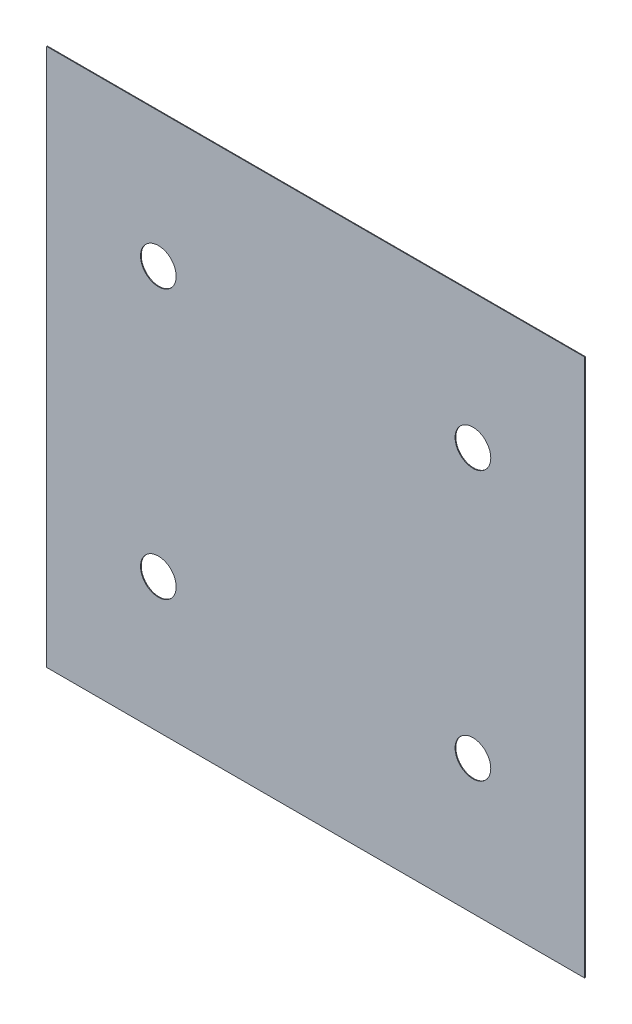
from build123d import *

# Parameters (mm, degrees)
SKETCH1_W           = 1196.975
SKETCH1_H           = 1196.975
BOSS_EXTRUDE1_DEPTH = 1.5875
SKETCH5_R           = 39.6875
CUT_EXTRUDE4_DEPTH  = 2.54


with BuildPart() as part:
    # Sketch1 → Boss-Extrude1 (new body)
    with BuildSketch(Plane.XY):
        Rectangle(SKETCH1_W, SKETCH1_H)
    extrude(amount=BOSS_EXTRUDE1_DEPTH)

    # Sketch5 → Cut-Extrude4 (cut)
    with BuildSketch(Plane.XY):
        with Locations((-350.04375, 299.24375)):
            Circle(SKETCH5_R)
        with Locations((-350.04375, -299.24375)):
            Circle(SKETCH5_R)
        with Locations((350.04375, 299.24375)):
            Circle(SKETCH5_R)
        with Locations((350.04375, -299.24375)):
            Circle(SKETCH5_R)
    extrude(amount=CUT_EXTRUDE4_DEPTH, mode=Mode.SUBTRACT)


solid = part.part
